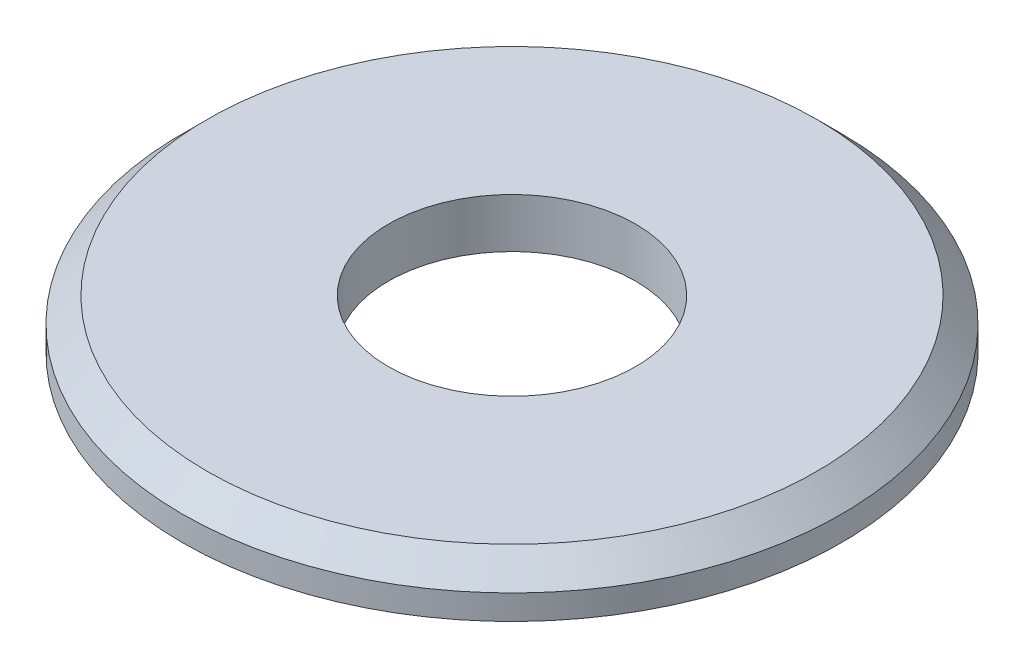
ISO-10303-21;
HEADER;
FILE_DESCRIPTION(('STEP AP214'),'2;1');
FILE_NAME('part.step','',(''),(''),'','','');
FILE_SCHEMA(('AUTOMOTIVE_DESIGN { 1 0 10303 214 1 1 1 1 }'));
ENDSEC;
DATA;
#1=APPLICATION_CONTEXT('core data for automotive mechanical design processes');
#2=APPLICATION_PROTOCOL_DEFINITION('international standard','automotive_design',2000,#1);
#3=PRODUCT_CONTEXT('',#1,'mechanical');
#4=PRODUCT('Part','Part','',(#3));
#5=PRODUCT_RELATED_PRODUCT_CATEGORY('part','',(#4));
#6=PRODUCT_DEFINITION_FORMATION('','',#4);
#7=PRODUCT_DEFINITION_CONTEXT('part definition',#1,'design');
#8=PRODUCT_DEFINITION('design','',#6,#7);
#9=PRODUCT_DEFINITION_SHAPE('','',#8);
#10=(LENGTH_UNIT() NAMED_UNIT(*) SI_UNIT(.MILLI.,.METRE.));
#11=(NAMED_UNIT(*) PLANE_ANGLE_UNIT() SI_UNIT($,.RADIAN.));
#12=(NAMED_UNIT(*) SI_UNIT($,.STERADIAN.) SOLID_ANGLE_UNIT());
#13=UNCERTAINTY_MEASURE_WITH_UNIT(LENGTH_MEASURE(1.E-05),#10,'distance_accuracy_value','');
#14=(GEOMETRIC_REPRESENTATION_CONTEXT(3) GLOBAL_UNCERTAINTY_ASSIGNED_CONTEXT((#13)) GLOBAL_UNIT_ASSIGNED_CONTEXT((#10,
#11,#12)) REPRESENTATION_CONTEXT('',''));
#15=CARTESIAN_POINT('',(0.,0.,0.));
#16=DIRECTION('',(0.,0.,1.));
#17=DIRECTION('',(1.,0.,0.));
#18=AXIS2_PLACEMENT_3D('',#15,#16,#17);
#19=CARTESIAN_POINT('',(0.,0.3,0.));
#20=DIRECTION('',(0.,1.,0.));
#21=DIRECTION('',(0.,0.,1.));
#22=AXIS2_PLACEMENT_3D('',#19,#20,#21);
#23=PLANE('',#22);
#24=CARTESIAN_POINT('',(0.,0.3,0.));
#25=DIRECTION('',(0.,1.,0.));
#26=DIRECTION('',(0.,0.,1.));
#27=AXIS2_PLACEMENT_3D('',#24,#25,#26);
#28=CIRCLE('',#27,1.85);
#29=CARTESIAN_POINT('',(0.,0.3,1.85));
#30=VERTEX_POINT('',#29);
#31=EDGE_CURVE('E35',#30,#30,#28,.T.);
#32=ORIENTED_EDGE('',*,*,#31,.T.);
#33=EDGE_LOOP('',(#32));
#34=FACE_BOUND('',#33,.T.);
#35=CARTESIAN_POINT('',(0.,0.3,0.));
#36=DIRECTION('',(0.,1.,0.));
#37=DIRECTION('',(0.,0.,1.));
#38=AXIS2_PLACEMENT_3D('',#35,#36,#37);
#39=CIRCLE('',#38,0.75);
#40=CARTESIAN_POINT('',(0.,0.3,0.75));
#41=VERTEX_POINT('',#40);
#42=EDGE_CURVE('E43',#41,#41,#39,.T.);
#43=ORIENTED_EDGE('',*,*,#42,.F.);
#44=EDGE_LOOP('',(#43));
#45=FACE_BOUND('',#44,.T.);
#46=ADVANCED_FACE('F28',(#34,#45),#23,.T.);
#47=CARTESIAN_POINT('',(0.,0.,0.));
#48=DIRECTION('',(0.,1.,0.));
#49=DIRECTION('',(0.,0.,1.));
#50=AXIS2_PLACEMENT_3D('',#47,#48,#49);
#51=PLANE('',#50);
#52=CARTESIAN_POINT('',(0.,0.,0.));
#53=DIRECTION('',(0.,1.,0.));
#54=DIRECTION('',(0.,0.,1.));
#55=AXIS2_PLACEMENT_3D('',#52,#53,#54);
#56=CIRCLE('',#55,2.);
#57=CARTESIAN_POINT('',(0.,0.,2.));
#58=VERTEX_POINT('',#57);
#59=EDGE_CURVE('E39',#58,#58,#56,.T.);
#60=ORIENTED_EDGE('',*,*,#59,.F.);
#61=EDGE_LOOP('',(#60));
#62=FACE_BOUND('',#61,.T.);
#63=CARTESIAN_POINT('',(0.,0.,0.));
#64=DIRECTION('',(0.,1.,0.));
#65=DIRECTION('',(0.,0.,1.));
#66=AXIS2_PLACEMENT_3D('',#63,#64,#65);
#67=CIRCLE('',#66,0.75);
#68=CARTESIAN_POINT('',(0.,0.,0.75));
#69=VERTEX_POINT('',#68);
#70=EDGE_CURVE('E48',#69,#69,#67,.T.);
#71=ORIENTED_EDGE('',*,*,#70,.T.);
#72=EDGE_LOOP('',(#71));
#73=FACE_BOUND('',#72,.T.);
#74=ADVANCED_FACE('F52',(#62,#73),#51,.F.);
#75=CARTESIAN_POINT('',(0.,0.3,0.));
#76=DIRECTION('',(0.,-1.,0.));
#77=DIRECTION('',(0.,0.,-1.));
#78=AXIS2_PLACEMENT_3D('',#75,#76,#77);
#79=CYLINDRICAL_SURFACE('',#78,2.);
#80=CARTESIAN_POINT('',(0.,0.15,0.));
#81=DIRECTION('',(0.,1.,0.));
#82=DIRECTION('',(0.,0.,1.));
#83=AXIS2_PLACEMENT_3D('',#80,#81,#82);
#84=CIRCLE('',#83,2.);
#85=CARTESIAN_POINT('',(0.,0.15,2.));
#86=VERTEX_POINT('',#85);
#87=EDGE_CURVE('E10',#86,#86,#84,.F.);
#88=ORIENTED_EDGE('',*,*,#87,.T.);
#89=EDGE_LOOP('',(#88));
#90=FACE_BOUND('',#89,.T.);
#91=ORIENTED_EDGE('',*,*,#59,.T.);
#92=EDGE_LOOP('',(#91));
#93=FACE_BOUND('',#92,.T.);
#94=ADVANCED_FACE('F30',(#90,#93),#79,.T.);
#95=CARTESIAN_POINT('',(0.,0.3,0.));
#96=DIRECTION('',(0.,-1.,0.));
#97=DIRECTION('',(0.,0.,-1.));
#98=AXIS2_PLACEMENT_3D('',#95,#96,#97);
#99=CYLINDRICAL_SURFACE('',#98,0.75);
#100=ORIENTED_EDGE('',*,*,#42,.T.);
#101=EDGE_LOOP('',(#100));
#102=FACE_BOUND('',#101,.T.);
#103=ORIENTED_EDGE('',*,*,#70,.F.);
#104=EDGE_LOOP('',(#103));
#105=FACE_BOUND('',#104,.T.);
#106=ADVANCED_FACE('F54',(#102,#105),#99,.F.);
#107=CARTESIAN_POINT('',(0.,0.3,0.));
#108=DIRECTION('',(0.,-1.,0.));
#109=DIRECTION('',(0.,0.,-1.));
#110=AXIS2_PLACEMENT_3D('',#107,#108,#109);
#111=CONICAL_SURFACE('',#110,1.85,0.78539816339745);
#112=ORIENTED_EDGE('',*,*,#87,.F.);
#113=EDGE_LOOP('',(#112));
#114=FACE_BOUND('',#113,.T.);
#115=ORIENTED_EDGE('',*,*,#31,.F.);
#116=EDGE_LOOP('',(#115));
#117=FACE_BOUND('',#116,.T.);
#118=ADVANCED_FACE('F56',(#114,#117),#111,.T.);
#119=CLOSED_SHELL('',(#46,#74,#94,#106,#118));
#120=MANIFOLD_SOLID_BREP('B2',#119);
#121=ADVANCED_BREP_SHAPE_REPRESENTATION('',(#18,#120),#14);
#122=SHAPE_DEFINITION_REPRESENTATION(#9,#121);
ENDSEC;
END-ISO-10303-21;
